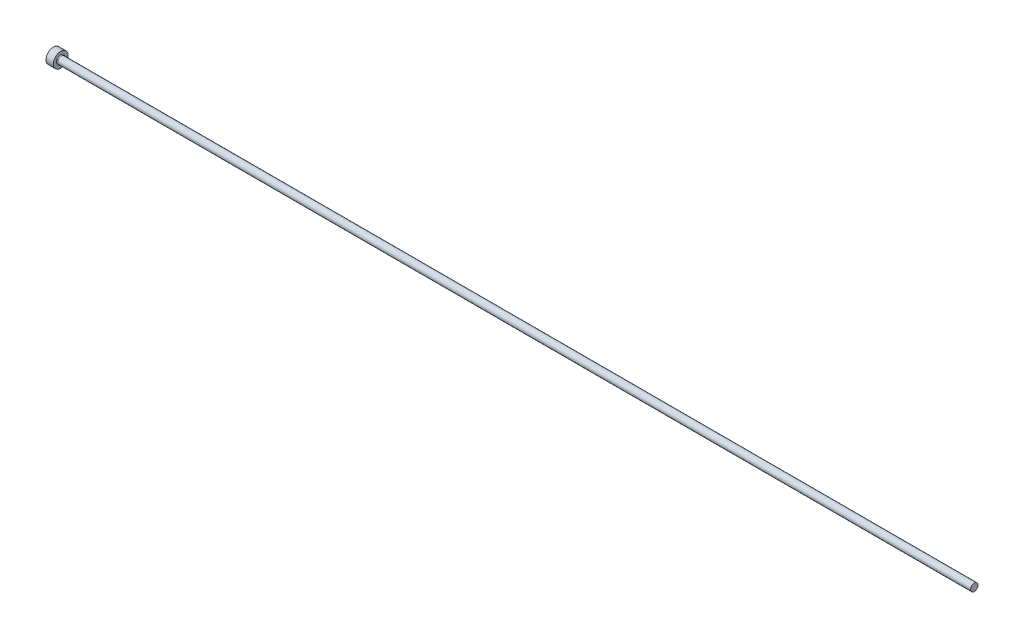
ISO-10303-21;
HEADER;
FILE_DESCRIPTION(('STEP AP214'),'2;1');
FILE_NAME('part.step','',(''),(''),'','','');
FILE_SCHEMA(('AUTOMOTIVE_DESIGN { 1 0 10303 214 1 1 1 1 }'));
ENDSEC;
DATA;
#1=APPLICATION_CONTEXT('core data for automotive mechanical design processes');
#2=APPLICATION_PROTOCOL_DEFINITION('international standard','automotive_design',2000,#1);
#3=PRODUCT_CONTEXT('',#1,'mechanical');
#4=PRODUCT('Part','Part','',(#3));
#5=PRODUCT_RELATED_PRODUCT_CATEGORY('part','',(#4));
#6=PRODUCT_DEFINITION_FORMATION('','',#4);
#7=PRODUCT_DEFINITION_CONTEXT('part definition',#1,'design');
#8=PRODUCT_DEFINITION('design','',#6,#7);
#9=PRODUCT_DEFINITION_SHAPE('','',#8);
#10=(LENGTH_UNIT() NAMED_UNIT(*) SI_UNIT(.MILLI.,.METRE.));
#11=(NAMED_UNIT(*) PLANE_ANGLE_UNIT() SI_UNIT($,.RADIAN.));
#12=(NAMED_UNIT(*) SI_UNIT($,.STERADIAN.) SOLID_ANGLE_UNIT());
#13=UNCERTAINTY_MEASURE_WITH_UNIT(LENGTH_MEASURE(1.E-05),#10,'distance_accuracy_value','');
#14=(GEOMETRIC_REPRESENTATION_CONTEXT(3) GLOBAL_UNCERTAINTY_ASSIGNED_CONTEXT((#13)) GLOBAL_UNIT_ASSIGNED_CONTEXT((#10,
#11,#12)) REPRESENTATION_CONTEXT('',''));
#15=CARTESIAN_POINT('',(0.,0.,0.));
#16=DIRECTION('',(0.,0.,1.));
#17=DIRECTION('',(1.,0.,0.));
#18=AXIS2_PLACEMENT_3D('',#15,#16,#17);
#19=CARTESIAN_POINT('',(0.,0.,0.));
#20=DIRECTION('',(-1.,0.,0.));
#21=DIRECTION('',(0.,-1.,0.));
#22=AXIS2_PLACEMENT_3D('',#19,#20,#21);
#23=PLANE('',#22);
#24=CARTESIAN_POINT('',(0.,0.,0.));
#25=DIRECTION('',(1.,0.,0.));
#26=DIRECTION('',(0.,1.,0.));
#27=AXIS2_PLACEMENT_3D('',#24,#25,#26);
#28=CIRCLE('',#27,2.);
#29=CARTESIAN_POINT('',(0.,2.,0.));
#30=VERTEX_POINT('',#29);
#31=EDGE_CURVE('E25',#30,#30,#28,.T.);
#32=ORIENTED_EDGE('',*,*,#31,.F.);
#33=EDGE_LOOP('',(#32));
#34=FACE_BOUND('',#33,.T.);
#35=ADVANCED_FACE('F14',(#34),#23,.T.);
#36=CARTESIAN_POINT('',(250.,0.,0.));
#37=DIRECTION('',(1.,0.,0.));
#38=DIRECTION('',(0.,1.,0.));
#39=AXIS2_PLACEMENT_3D('',#36,#37,#38);
#40=CYLINDRICAL_SURFACE('',#39,2.);
#41=ORIENTED_EDGE('',*,*,#31,.T.);
#42=EDGE_LOOP('',(#41));
#43=FACE_BOUND('',#42,.T.);
#44=CARTESIAN_POINT('',(2.,0.,0.));
#45=DIRECTION('',(1.,0.,0.));
#46=DIRECTION('',(0.,1.,0.));
#47=AXIS2_PLACEMENT_3D('',#44,#45,#46);
#48=CIRCLE('',#47,2.);
#49=CARTESIAN_POINT('',(2.,2.,0.));
#50=VERTEX_POINT('',#49);
#51=EDGE_CURVE('E29',#50,#50,#48,.T.);
#52=ORIENTED_EDGE('',*,*,#51,.F.);
#53=EDGE_LOOP('',(#52));
#54=FACE_BOUND('',#53,.T.);
#55=ADVANCED_FACE('F51',(#43,#54),#40,.T.);
#56=CARTESIAN_POINT('',(2.,2.,0.));
#57=DIRECTION('',(1.,0.,0.));
#58=DIRECTION('',(0.,1.,0.));
#59=AXIS2_PLACEMENT_3D('',#56,#57,#58);
#60=PLANE('',#59);
#61=CARTESIAN_POINT('',(2.,0.,0.));
#62=DIRECTION('',(1.,0.,0.));
#63=DIRECTION('',(0.,1.,0.));
#64=AXIS2_PLACEMENT_3D('',#61,#62,#63);
#65=CIRCLE('',#64,1.19999999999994);
#66=CARTESIAN_POINT('',(2.,1.19999999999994,0.));
#67=VERTEX_POINT('',#66);
#68=EDGE_CURVE('E9',#67,#67,#65,.F.);
#69=ORIENTED_EDGE('',*,*,#68,.T.);
#70=EDGE_LOOP('',(#69));
#71=FACE_BOUND('',#70,.T.);
#72=ORIENTED_EDGE('',*,*,#51,.T.);
#73=EDGE_LOOP('',(#72));
#74=FACE_BOUND('',#73,.T.);
#75=ADVANCED_FACE('F42',(#71,#74),#60,.T.);
#76=CARTESIAN_POINT('',(250.,0.,0.));
#77=DIRECTION('',(1.,0.,0.));
#78=DIRECTION('',(0.,1.,0.));
#79=AXIS2_PLACEMENT_3D('',#76,#77,#78);
#80=CYLINDRICAL_SURFACE('',#79,0.999999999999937);
#81=CARTESIAN_POINT('',(2.2,0.,0.));
#82=DIRECTION('',(1.,0.,0.));
#83=DIRECTION('',(0.,1.,0.));
#84=AXIS2_PLACEMENT_3D('',#81,#82,#83);
#85=CIRCLE('',#84,0.999999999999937);
#86=CARTESIAN_POINT('',(2.2,0.999999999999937,0.));
#87=VERTEX_POINT('',#86);
#88=EDGE_CURVE('E21',#87,#87,#85,.T.);
#89=ORIENTED_EDGE('',*,*,#88,.T.);
#90=EDGE_LOOP('',(#89));
#91=FACE_BOUND('',#90,.T.);
#92=CARTESIAN_POINT('',(250.,0.,0.));
#93=DIRECTION('',(1.,0.,0.));
#94=DIRECTION('',(0.,1.,0.));
#95=AXIS2_PLACEMENT_3D('',#92,#93,#94);
#96=CIRCLE('',#95,0.99999999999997);
#97=CARTESIAN_POINT('',(250.,0.999999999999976,0.));
#98=VERTEX_POINT('',#97);
#99=EDGE_CURVE('E34',#98,#98,#96,.T.);
#100=ORIENTED_EDGE('',*,*,#99,.F.);
#101=EDGE_LOOP('',(#100));
#102=FACE_BOUND('',#101,.T.);
#103=ADVANCED_FACE('F40',(#91,#102),#80,.T.);
#104=CARTESIAN_POINT('',(250.,0.999999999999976,0.));
#105=DIRECTION('',(1.,0.,0.));
#106=DIRECTION('',(0.,1.,0.));
#107=AXIS2_PLACEMENT_3D('',#104,#105,#106);
#108=PLANE('',#107);
#109=ORIENTED_EDGE('',*,*,#99,.T.);
#110=EDGE_LOOP('',(#109));
#111=FACE_BOUND('',#110,.T.);
#112=ADVANCED_FACE('F38',(#111),#108,.T.);
#113=CARTESIAN_POINT('',(2.2,0.,0.));
#114=DIRECTION('',(1.,0.,0.));
#115=DIRECTION('',(0.,1.,0.));
#116=AXIS2_PLACEMENT_3D('',#113,#114,#115);
#117=TOROIDAL_SURFACE('',#116,1.19999999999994,0.2);
#118=ORIENTED_EDGE('',*,*,#68,.F.);
#119=EDGE_LOOP('',(#118));
#120=FACE_BOUND('',#119,.T.);
#121=ORIENTED_EDGE('',*,*,#88,.F.);
#122=EDGE_LOOP('',(#121));
#123=FACE_BOUND('',#122,.T.);
#124=ADVANCED_FACE('F16',(#120,#123),#117,.F.);
#125=CLOSED_SHELL('',(#35,#55,#75,#103,#112,#124));
#126=MANIFOLD_SOLID_BREP('B1',#125);
#127=ADVANCED_BREP_SHAPE_REPRESENTATION('',(#18,#126),#14);
#128=SHAPE_DEFINITION_REPRESENTATION(#9,#127);
ENDSEC;
END-ISO-10303-21;
